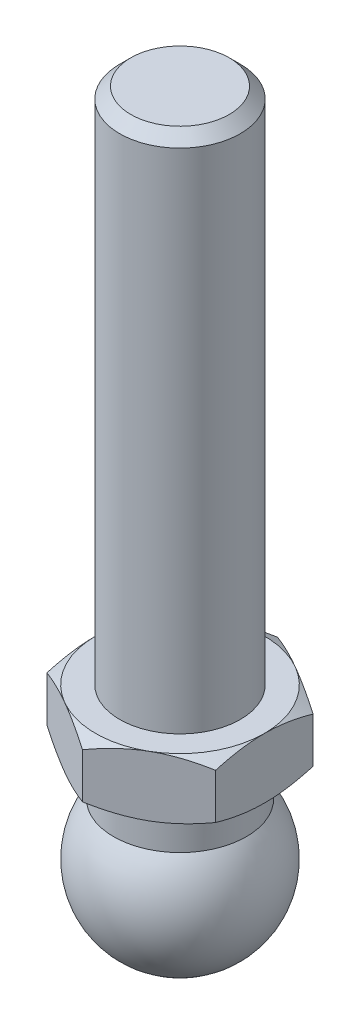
ISO-10303-21;
HEADER;
FILE_DESCRIPTION(('STEP AP214'),'2;1');
FILE_NAME('part.step','',(''),(''),'','','');
FILE_SCHEMA(('AUTOMOTIVE_DESIGN { 1 0 10303 214 1 1 1 1 }'));
ENDSEC;
DATA;
#1=APPLICATION_CONTEXT('core data for automotive mechanical design processes');
#2=APPLICATION_PROTOCOL_DEFINITION('international standard','automotive_design',2000,#1);
#3=PRODUCT_CONTEXT('',#1,'mechanical');
#4=PRODUCT('Part','Part','',(#3));
#5=PRODUCT_RELATED_PRODUCT_CATEGORY('part','',(#4));
#6=PRODUCT_DEFINITION_FORMATION('','',#4);
#7=PRODUCT_DEFINITION_CONTEXT('part definition',#1,'design');
#8=PRODUCT_DEFINITION('design','',#6,#7);
#9=PRODUCT_DEFINITION_SHAPE('','',#8);
#10=(LENGTH_UNIT() NAMED_UNIT(*) SI_UNIT(.MILLI.,.METRE.));
#11=(NAMED_UNIT(*) PLANE_ANGLE_UNIT() SI_UNIT($,.RADIAN.));
#12=(NAMED_UNIT(*) SI_UNIT($,.STERADIAN.) SOLID_ANGLE_UNIT());
#13=UNCERTAINTY_MEASURE_WITH_UNIT(LENGTH_MEASURE(1.E-05),#10,'distance_accuracy_value','');
#14=(GEOMETRIC_REPRESENTATION_CONTEXT(3) GLOBAL_UNCERTAINTY_ASSIGNED_CONTEXT((#13)) GLOBAL_UNIT_ASSIGNED_CONTEXT((#10,
#11,#12)) REPRESENTATION_CONTEXT('',''));
#15=CARTESIAN_POINT('',(0.,0.,0.));
#16=DIRECTION('',(0.,0.,1.));
#17=DIRECTION('',(1.,0.,0.));
#18=AXIS2_PLACEMENT_3D('',#15,#16,#17);
#19=CARTESIAN_POINT('',(0.,19.5,0.));
#20=DIRECTION('',(0.,-1.,0.));
#21=DIRECTION('',(0.,0.,-1.));
#22=AXIS2_PLACEMENT_3D('',#19,#20,#21);
#23=CONICAL_SURFACE('',#22,7.,1.0471975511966);
#24=CARTESIAN_POINT('',(-7.,15.2688336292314,12.5023453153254));
#25=CARTESIAN_POINT('',(-7.,15.4184696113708,12.2052647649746));
#26=CARTESIAN_POINT('',(-7.,15.5671267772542,11.9076861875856));
#27=CARTESIAN_POINT('',(-7.,15.8620076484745,11.3113035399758));
#28=CARTESIAN_POINT('',(-7.,16.0082312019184,11.0124993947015));
#29=CARTESIAN_POINT('',(-7.,16.2980281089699,10.4128982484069));
#30=CARTESIAN_POINT('',(-7.,16.441595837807,10.1120985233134));
#31=CARTESIAN_POINT('',(-7.,16.7251296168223,9.50881013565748));
#32=CARTESIAN_POINT('',(-7.,16.8650957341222,9.20632150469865));
#33=CARTESIAN_POINT('',(-7.,17.1470427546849,8.58510325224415));
#34=CARTESIAN_POINT('',(-7.,17.2888108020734,8.26627671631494));
#35=CARTESIAN_POINT('',(-7.,17.5662200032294,7.62594250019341));
#36=CARTESIAN_POINT('',(-7.,17.7018608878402,7.30443470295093));
#37=CARTESIAN_POINT('',(-7.,17.9652496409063,6.65840905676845));
#38=CARTESIAN_POINT('',(-7.,18.0930022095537,6.33389313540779));
#39=CARTESIAN_POINT('',(-7.,18.3384540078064,5.68109770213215));
#40=CARTESIAN_POINT('',(-7.,18.4561543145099,5.35281859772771));
#41=CARTESIAN_POINT('',(-7.,18.7028165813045,4.61998548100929));
#42=CARTESIAN_POINT('',(-7.,18.8286623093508,4.21436746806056));
#43=CARTESIAN_POINT('',(-7.,19.0543524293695,3.39574912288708));
#44=CARTESIAN_POINT('',(-7.,19.1541980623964,2.98274914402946));
#45=CARTESIAN_POINT('',(-7.,19.2776062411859,2.36178861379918));
#46=CARTESIAN_POINT('',(-7.,19.3141378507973,2.15638627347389));
#47=CARTESIAN_POINT('',(-7.,19.3780104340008,1.74416917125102));
#48=CARTESIAN_POINT('',(-7.,19.4053527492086,1.53735462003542));
#49=CARTESIAN_POINT('',(-7.,19.4500375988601,1.1227076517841));
#50=CARTESIAN_POINT('',(-7.,19.467383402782,0.914875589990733));
#51=CARTESIAN_POINT('',(-7.,19.4915250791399,0.498594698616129));
#52=CARTESIAN_POINT('',(-7.,19.4983210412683,0.290145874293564));
#53=CARTESIAN_POINT('',(-7.,19.5011397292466,-0.128421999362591));
#54=CARTESIAN_POINT('',(-7.,19.4970795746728,-0.338541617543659));
#55=CARTESIAN_POINT('',(-7.,19.4781521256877,-0.758289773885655));
#56=CARTESIAN_POINT('',(-7.,19.463284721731,-0.967918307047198));
#57=CARTESIAN_POINT('',(-7.,19.4232345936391,-1.38625975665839));
#58=CARTESIAN_POINT('',(-7.,19.3980479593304,-1.59497229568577));
#59=CARTESIAN_POINT('',(-7.,19.3381380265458,-2.01100790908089));
#60=CARTESIAN_POINT('',(-7.,19.3034145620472,-2.21833095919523));
#61=CARTESIAN_POINT('',(-7.,19.1849408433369,-2.84522045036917));
#62=CARTESIAN_POINT('',(-7.,19.0876569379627,-3.26225118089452));
#63=CARTESIAN_POINT('',(-7.,18.8658468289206,-4.08879182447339));
#64=CARTESIAN_POINT('',(-7.,18.7413180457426,-4.4983010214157));
#65=CARTESIAN_POINT('',(-7.,18.4953846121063,-5.2406101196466));
#66=CARTESIAN_POINT('',(-7.,18.3771372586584,-5.5744719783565));
#67=CARTESIAN_POINT('',(-7.,18.1300009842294,-6.23825206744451));
#68=CARTESIAN_POINT('',(-7.,18.0011107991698,-6.56816982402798));
#69=CARTESIAN_POINT('',(-7.,17.7350197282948,-7.22486424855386));
#70=CARTESIAN_POINT('',(-7.,17.5978135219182,-7.55163874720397));
#71=CARTESIAN_POINT('',(-7.,17.3169731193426,-8.20238370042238));
#72=CARTESIAN_POINT('',(-7.,17.1733392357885,-8.5263542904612));
#73=CARTESIAN_POINT('',(-7.,16.8876445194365,-9.15729037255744));
#74=CARTESIAN_POINT('',(-7.,16.7458097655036,-9.46435857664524));
#75=CARTESIAN_POINT('',(-7.,16.4583976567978,-10.0767426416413));
#76=CARTESIAN_POINT('',(-7.,16.3128202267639,-10.3820584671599));
#77=CARTESIAN_POINT('',(-7.,16.018926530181,-10.990585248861));
#78=CARTESIAN_POINT('',(-7.,15.8706165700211,-11.2937992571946));
#79=CARTESIAN_POINT('',(-7.,15.5714843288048,-11.8989613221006));
#80=CARTESIAN_POINT('',(-7.,15.4206622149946,-12.2009094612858));
#81=CARTESIAN_POINT('',(-7.,15.2688336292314,-12.5023453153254));
#82=B_SPLINE_CURVE_WITH_KNOTS('',3,(#24,#25,#26,#27,#28,#29,#30,#31,#32,#33,#34,#35,#36,#37,#38,
#39,#40,#41,#42,#43,#44,#45,#46,#47,#48,#49,#50,#51,#52,#53,#54,#55,#56,#57,#58,#59,#60,#61,#62,
#63,#64,#65,#66,#67,#68,#69,#70,#71,#72,#73,#74,#75,#76,#77,#78,#79,#80,#81),.UNSPECIFIED.,.F.,
.F.,(4,2,2,2,2,2,2,2,2,2,2,2,2,2,2,2,2,2,2,2,2,2,2,2,2,2,2,2,4),(0.,0.997917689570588,
1.99589743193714,2.99579247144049,3.99566886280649,5.04239250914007,6.08916209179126,
7.13530182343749,8.18132932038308,9.45480706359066,10.7282240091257,11.3539282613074,
11.9795411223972,12.6049492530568,13.2303520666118,13.8605430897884,14.490740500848,
15.1211769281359,15.7516243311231,17.0349275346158,18.3183522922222,19.380686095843,
20.4431462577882,21.506293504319,22.5693890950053,23.5840866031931,24.5988045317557,
25.6114179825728,26.6239642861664),.UNSPECIFIED.);
#83=CARTESIAN_POINT('',(-7.,18.8747852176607,4.04145188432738));
#84=VERTEX_POINT('',#83);
#85=CARTESIAN_POINT('',(-7.,19.5,0.));
#86=VERTEX_POINT('',#85);
#87=EDGE_CURVE('E255',#84,#86,#82,.T.);
#88=ORIENTED_EDGE('',*,*,#87,.F.);
#89=CARTESIAN_POINT('',(0.0002,18.8747185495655,8.0830192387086));
#90=CARTESIAN_POINT('',(-0.153667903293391,18.9260001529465,7.99418356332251));
#91=CARTESIAN_POINT('',(-0.30810950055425,18.9749544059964,7.90501666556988));
#92=CARTESIAN_POINT('',(-0.618246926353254,19.0675672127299,7.72595873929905));
#93=CARTESIAN_POINT('',(-0.773943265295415,19.1112234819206,7.63606741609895));
#94=CARTESIAN_POINT('',(-1.24352516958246,19.2333884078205,7.36495417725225));
#95=CARTESIAN_POINT('',(-1.5592643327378,19.302874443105,7.18266208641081));
#96=CARTESIAN_POINT('',(-2.03176224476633,19.3843550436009,6.9098652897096));
#97=CARTESIAN_POINT('',(-2.18710922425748,19.4075665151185,6.82017566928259));
#98=CARTESIAN_POINT('',(-2.49850511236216,19.4464887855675,6.64039116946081));
#99=CARTESIAN_POINT('',(-2.65455395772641,19.4622002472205,6.55029632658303));
#100=CARTESIAN_POINT('',(-2.96692267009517,19.4857220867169,6.36995016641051));
#101=CARTESIAN_POINT('',(-3.12324202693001,19.4935414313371,6.27969914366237));
#102=CARTESIAN_POINT('',(-3.43601650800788,19.5011197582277,6.09911871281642));
#103=CARTESIAN_POINT('',(-3.59247162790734,19.500878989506,6.00878930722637));
#104=CARTESIAN_POINT('',(-4.02110687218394,19.4891402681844,5.76131663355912));
#105=CARTESIAN_POINT('',(-4.2931466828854,19.4694342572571,5.60425437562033));
#106=CARTESIAN_POINT('',(-4.83541944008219,19.4069465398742,5.29117305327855));
#107=CARTESIAN_POINT('',(-5.10565047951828,19.364143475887,5.13515508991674));
#108=CARTESIAN_POINT('',(-5.64901454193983,19.2571483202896,4.82144370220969));
#109=CARTESIAN_POINT('',(-5.92207900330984,19.1925029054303,4.66378986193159));
#110=CARTESIAN_POINT('',(-6.46413578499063,19.045783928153,4.35083323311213));
#111=CARTESIAN_POINT('',(-6.73313504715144,18.9637448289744,4.19552643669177));
#112=CARTESIAN_POINT('',(-7.0002,18.8747185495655,4.04133641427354));
#113=B_SPLINE_CURVE_WITH_KNOTS('',3,(#89,#90,#91,#92,#93,#94,#95,#96,#97,#98,#99,#100,#101,#102,
#103,#104,#105,#106,#107,#108,#109,#110,#111,#112),.UNSPECIFIED.,.F.,.F.,(4,2,2,2,2,2,2,2,2,2,2,
4),(0.,0.554727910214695,1.10969417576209,2.2219327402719,2.76443041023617,3.30688013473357,
3.8487128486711,4.39052882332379,5.33376515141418,6.27787517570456,7.2429241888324,
8.20607866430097),.UNSPECIFIED.);
#114=CARTESIAN_POINT('',(-3.5,19.5,6.06217782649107));
#115=VERTEX_POINT('',#114);
#116=EDGE_CURVE('E141',#115,#84,#113,.T.);
#117=ORIENTED_EDGE('',*,*,#116,.F.);
#118=CARTESIAN_POINT('',(0.,19.5,0.));
#119=DIRECTION('',(0.,-1.,0.));
#120=DIRECTION('',(0.,0.,-1.));
#121=AXIS2_PLACEMENT_3D('',#118,#119,#120);
#122=CIRCLE('',#121,7.);
#123=EDGE_CURVE('E223',#115,#86,#122,.T.);
#124=ORIENTED_EDGE('',*,*,#123,.T.);
#125=EDGE_LOOP('',(#88,#117,#124));
#126=FACE_BOUND('',#125,.T.);
#127=ADVANCED_FACE('F14',(#126),#23,.T.);
#128=CARTESIAN_POINT('',(-7.,18.8747852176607,-4.04145188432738));
#129=VERTEX_POINT('',#128);
#130=EDGE_CURVE('E257',#86,#129,#82,.T.);
#131=ORIENTED_EDGE('',*,*,#130,.F.);
#132=CARTESIAN_POINT('',(-3.5,19.5,-6.06217782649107));
#133=VERTEX_POINT('',#132);
#134=EDGE_CURVE('E240',#86,#133,#122,.T.);
#135=ORIENTED_EDGE('',*,*,#134,.T.);
#136=CARTESIAN_POINT('',(-7.0002,18.8747185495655,-4.04133641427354));
#137=CARTESIAN_POINT('',(-6.84633209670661,18.9260001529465,-4.13017208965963));
#138=CARTESIAN_POINT('',(-6.69189049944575,18.9749544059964,-4.21933898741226));
#139=CARTESIAN_POINT('',(-6.38175307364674,19.0675672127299,-4.39839691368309));
#140=CARTESIAN_POINT('',(-6.22605673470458,19.1112234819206,-4.48828823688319));
#141=CARTESIAN_POINT('',(-5.75647483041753,19.2333884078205,-4.75940147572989));
#142=CARTESIAN_POINT('',(-5.4407356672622,19.302874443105,-4.94169356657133));
#143=CARTESIAN_POINT('',(-4.96823775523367,19.3843550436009,-5.21449036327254));
#144=CARTESIAN_POINT('',(-4.81289077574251,19.4075665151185,-5.30417998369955));
#145=CARTESIAN_POINT('',(-4.50149488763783,19.4464887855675,-5.48396448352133));
#146=CARTESIAN_POINT('',(-4.34544604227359,19.4622002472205,-5.57405932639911));
#147=CARTESIAN_POINT('',(-4.03307732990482,19.4857220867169,-5.75440548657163));
#148=CARTESIAN_POINT('',(-3.87675797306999,19.4935414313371,-5.84465650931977));
#149=CARTESIAN_POINT('',(-3.56398349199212,19.5011197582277,-6.02523694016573));
#150=CARTESIAN_POINT('',(-3.40752837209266,19.500878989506,-6.11556634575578));
#151=CARTESIAN_POINT('',(-2.97889312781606,19.4891402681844,-6.36303901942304));
#152=CARTESIAN_POINT('',(-2.7068533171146,19.4694342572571,-6.52010127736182));
#153=CARTESIAN_POINT('',(-2.1645805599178,19.4069465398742,-6.83318259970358));
#154=CARTESIAN_POINT('',(-1.89434952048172,19.364143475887,-6.9892005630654));
#155=CARTESIAN_POINT('',(-1.35098545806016,19.2571483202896,-7.30291195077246));
#156=CARTESIAN_POINT('',(-1.07792099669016,19.1925029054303,-7.46056579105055));
#157=CARTESIAN_POINT('',(-0.53586421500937,19.045783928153,-7.77352241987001));
#158=CARTESIAN_POINT('',(-0.26686495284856,18.9637448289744,-7.92882921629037));
#159=CARTESIAN_POINT('',(0.000200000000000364,18.8747185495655,-8.0830192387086));
#160=B_SPLINE_CURVE_WITH_KNOTS('',3,(#136,#137,#138,#139,#140,#141,#142,#143,#144,#145,#146,
#147,#148,#149,#150,#151,#152,#153,#154,#155,#156,#157,#158,#159),.UNSPECIFIED.,.F.,.F.,(4,2,2,
2,2,2,2,2,2,2,2,4),(0.,0.554727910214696,1.10969417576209,2.2219327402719,2.76443041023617,
3.30688013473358,3.8487128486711,4.39052882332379,5.33376515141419,6.27787517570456,
7.2429241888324,8.20607866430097),.UNSPECIFIED.);
#161=EDGE_CURVE('E298',#129,#133,#160,.T.);
#162=ORIENTED_EDGE('',*,*,#161,.F.);
#163=EDGE_LOOP('',(#131,#135,#162));
#164=FACE_BOUND('',#163,.T.);
#165=ADVANCED_FACE('F179',(#164),#23,.T.);
#166=CARTESIAN_POINT('',(0.,18.8747852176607,-8.08290376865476));
#167=VERTEX_POINT('',#166);
#168=EDGE_CURVE('E293',#133,#167,#160,.T.);
#169=ORIENTED_EDGE('',*,*,#168,.F.);
#170=CARTESIAN_POINT('',(3.5,19.5,-6.06217782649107));
#171=VERTEX_POINT('',#170);
#172=EDGE_CURVE('E234',#133,#171,#122,.T.);
#173=ORIENTED_EDGE('',*,*,#172,.T.);
#174=CARTESIAN_POINT('',(-0.0002,18.8747185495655,-8.0830192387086));
#175=CARTESIAN_POINT('',(0.153667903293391,18.9260001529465,-7.99418356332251));
#176=CARTESIAN_POINT('',(0.30810950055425,18.9749544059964,-7.90501666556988));
#177=CARTESIAN_POINT('',(0.618246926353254,19.0675672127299,-7.72595873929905));
#178=CARTESIAN_POINT('',(0.773943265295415,19.1112234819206,-7.63606741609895));
#179=CARTESIAN_POINT('',(1.24352516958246,19.2333884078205,-7.36495417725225));
#180=CARTESIAN_POINT('',(1.5592643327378,19.302874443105,-7.18266208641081));
#181=CARTESIAN_POINT('',(2.03176224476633,19.3843550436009,-6.9098652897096));
#182=CARTESIAN_POINT('',(2.18710922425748,19.4075665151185,-6.82017566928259));
#183=CARTESIAN_POINT('',(2.49850511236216,19.4464887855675,-6.64039116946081));
#184=CARTESIAN_POINT('',(2.65455395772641,19.4622002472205,-6.55029632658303));
#185=CARTESIAN_POINT('',(2.96692267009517,19.4857220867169,-6.36995016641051));
#186=CARTESIAN_POINT('',(3.12324202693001,19.4935414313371,-6.27969914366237));
#187=CARTESIAN_POINT('',(3.43601650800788,19.5011197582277,-6.09911871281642));
#188=CARTESIAN_POINT('',(3.59247162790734,19.500878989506,-6.00878930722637));
#189=CARTESIAN_POINT('',(4.02110687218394,19.4891402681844,-5.76131663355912));
#190=CARTESIAN_POINT('',(4.2931466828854,19.4694342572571,-5.60425437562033));
#191=CARTESIAN_POINT('',(4.83541944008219,19.4069465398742,-5.29117305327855));
#192=CARTESIAN_POINT('',(5.10565047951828,19.364143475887,-5.13515508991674));
#193=CARTESIAN_POINT('',(5.64901454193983,19.2571483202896,-4.82144370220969));
#194=CARTESIAN_POINT('',(5.92207900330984,19.1925029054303,-4.66378986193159));
#195=CARTESIAN_POINT('',(6.46413578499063,19.045783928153,-4.35083323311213));
#196=CARTESIAN_POINT('',(6.73313504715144,18.9637448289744,-4.19552643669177));
#197=CARTESIAN_POINT('',(7.0002,18.8747185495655,-4.04133641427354));
#198=B_SPLINE_CURVE_WITH_KNOTS('',3,(#174,#175,#176,#177,#178,#179,#180,#181,#182,#183,#184,
#185,#186,#187,#188,#189,#190,#191,#192,#193,#194,#195,#196,#197),.UNSPECIFIED.,.F.,.F.,(4,2,2,
2,2,2,2,2,2,2,2,4),(0.,0.554727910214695,1.10969417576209,2.2219327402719,2.76443041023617,
3.30688013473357,3.8487128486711,4.39052882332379,5.33376515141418,6.27787517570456,
7.2429241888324,8.20607866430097),.UNSPECIFIED.);
#199=EDGE_CURVE('E304',#167,#171,#198,.T.);
#200=ORIENTED_EDGE('',*,*,#199,.F.);
#201=EDGE_LOOP('',(#169,#173,#200));
#202=FACE_BOUND('',#201,.T.);
#203=ADVANCED_FACE('F186',(#202),#23,.T.);
#204=CARTESIAN_POINT('',(7.,18.8747852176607,-4.04145188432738));
#205=VERTEX_POINT('',#204);
#206=EDGE_CURVE('E306',#171,#205,#198,.T.);
#207=ORIENTED_EDGE('',*,*,#206,.F.);
#208=CARTESIAN_POINT('',(7.,19.5,0.));
#209=VERTEX_POINT('',#208);
#210=EDGE_CURVE('E230',#171,#209,#122,.T.);
#211=ORIENTED_EDGE('',*,*,#210,.T.);
#212=CARTESIAN_POINT('',(7.,15.2688336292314,-12.5023453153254));
#213=CARTESIAN_POINT('',(7.,15.4184696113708,-12.2052647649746));
#214=CARTESIAN_POINT('',(7.,15.5671267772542,-11.9076861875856));
#215=CARTESIAN_POINT('',(7.,15.8620076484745,-11.3113035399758));
#216=CARTESIAN_POINT('',(7.,16.0082312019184,-11.0124993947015));
#217=CARTESIAN_POINT('',(7.,16.2980281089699,-10.4128982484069));
#218=CARTESIAN_POINT('',(7.,16.441595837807,-10.1120985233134));
#219=CARTESIAN_POINT('',(7.,16.7251296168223,-9.50881013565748));
#220=CARTESIAN_POINT('',(7.,16.8650957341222,-9.20632150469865));
#221=CARTESIAN_POINT('',(7.,17.1470427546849,-8.58510325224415));
#222=CARTESIAN_POINT('',(7.,17.2888108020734,-8.26627671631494));
#223=CARTESIAN_POINT('',(7.,17.5662200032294,-7.62594250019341));
#224=CARTESIAN_POINT('',(7.,17.7018608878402,-7.30443470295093));
#225=CARTESIAN_POINT('',(7.,17.9652496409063,-6.65840905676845));
#226=CARTESIAN_POINT('',(7.,18.0930022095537,-6.33389313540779));
#227=CARTESIAN_POINT('',(7.,18.3384540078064,-5.68109770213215));
#228=CARTESIAN_POINT('',(7.,18.4561543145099,-5.35281859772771));
#229=CARTESIAN_POINT('',(7.,18.7028165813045,-4.61998548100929));
#230=CARTESIAN_POINT('',(7.,18.8286623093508,-4.21436746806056));
#231=CARTESIAN_POINT('',(7.,19.0543524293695,-3.39574912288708));
#232=CARTESIAN_POINT('',(7.,19.1541980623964,-2.98274914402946));
#233=CARTESIAN_POINT('',(7.,19.2776062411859,-2.36178861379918));
#234=CARTESIAN_POINT('',(7.,19.3141378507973,-2.15638627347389));
#235=CARTESIAN_POINT('',(7.,19.3780104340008,-1.74416917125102));
#236=CARTESIAN_POINT('',(7.,19.4053527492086,-1.53735462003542));
#237=CARTESIAN_POINT('',(7.,19.4500375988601,-1.1227076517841));
#238=CARTESIAN_POINT('',(7.,19.467383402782,-0.914875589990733));
#239=CARTESIAN_POINT('',(7.,19.4915250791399,-0.498594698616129));
#240=CARTESIAN_POINT('',(7.,19.4983210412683,-0.290145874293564));
#241=CARTESIAN_POINT('',(7.,19.5011397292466,0.128421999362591));
#242=CARTESIAN_POINT('',(7.,19.4970795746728,0.338541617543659));
#243=CARTESIAN_POINT('',(7.,19.4781521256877,0.758289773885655));
#244=CARTESIAN_POINT('',(7.,19.463284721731,0.967918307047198));
#245=CARTESIAN_POINT('',(7.,19.4232345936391,1.38625975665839));
#246=CARTESIAN_POINT('',(7.,19.3980479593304,1.59497229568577));
#247=CARTESIAN_POINT('',(7.,19.3381380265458,2.01100790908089));
#248=CARTESIAN_POINT('',(7.,19.3034145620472,2.21833095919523));
#249=CARTESIAN_POINT('',(7.,19.1849408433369,2.84522045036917));
#250=CARTESIAN_POINT('',(7.,19.0876569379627,3.26225118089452));
#251=CARTESIAN_POINT('',(7.,18.8658468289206,4.08879182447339));
#252=CARTESIAN_POINT('',(7.,18.7413180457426,4.4983010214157));
#253=CARTESIAN_POINT('',(7.,18.4953846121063,5.2406101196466));
#254=CARTESIAN_POINT('',(7.,18.3771372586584,5.5744719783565));
#255=CARTESIAN_POINT('',(7.,18.1300009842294,6.23825206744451));
#256=CARTESIAN_POINT('',(7.,18.0011107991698,6.56816982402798));
#257=CARTESIAN_POINT('',(7.,17.7350197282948,7.22486424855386));
#258=CARTESIAN_POINT('',(7.,17.5978135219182,7.55163874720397));
#259=CARTESIAN_POINT('',(7.,17.3169731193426,8.20238370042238));
#260=CARTESIAN_POINT('',(7.,17.1733392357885,8.5263542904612));
#261=CARTESIAN_POINT('',(7.,16.8876445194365,9.15729037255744));
#262=CARTESIAN_POINT('',(7.,16.7458097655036,9.46435857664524));
#263=CARTESIAN_POINT('',(7.,16.4583976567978,10.0767426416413));
#264=CARTESIAN_POINT('',(7.,16.3128202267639,10.3820584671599));
#265=CARTESIAN_POINT('',(7.,16.018926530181,10.990585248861));
#266=CARTESIAN_POINT('',(7.,15.8706165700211,11.2937992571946));
#267=CARTESIAN_POINT('',(7.,15.5714843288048,11.8989613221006));
#268=CARTESIAN_POINT('',(7.,15.4206622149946,12.2009094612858));
#269=CARTESIAN_POINT('',(7.,15.2688336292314,12.5023453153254));
#270=B_SPLINE_CURVE_WITH_KNOTS('',3,(#212,#213,#214,#215,#216,#217,#218,#219,#220,#221,#222,
#223,#224,#225,#226,#227,#228,#229,#230,#231,#232,#233,#234,#235,#236,#237,#238,#239,#240,#241,
#242,#243,#244,#245,#246,#247,#248,#249,#250,#251,#252,#253,#254,#255,#256,#257,#258,#259,#260,
#261,#262,#263,#264,#265,#266,#267,#268,#269),.UNSPECIFIED.,.F.,.F.,(4,2,2,2,2,2,2,2,2,2,2,2,2,
2,2,2,2,2,2,2,2,2,2,2,2,2,2,2,4),(0.,0.997917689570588,1.99589743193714,2.99579247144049,
3.99566886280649,5.04239250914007,6.08916209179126,7.13530182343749,8.18132932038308,
9.45480706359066,10.7282240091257,11.3539282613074,11.9795411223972,12.6049492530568,
13.2303520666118,13.8605430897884,14.490740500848,15.1211769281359,15.7516243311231,
17.0349275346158,18.3183522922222,19.380686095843,20.4431462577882,21.506293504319,
22.5693890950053,23.5840866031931,24.5988045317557,25.6114179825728,26.6239642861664),.UNSPECIFIED.);
#271=EDGE_CURVE('E321',#205,#209,#270,.T.);
#272=ORIENTED_EDGE('',*,*,#271,.F.);
#273=EDGE_LOOP('',(#207,#211,#272));
#274=FACE_BOUND('',#273,.T.);
#275=ADVANCED_FACE('F201',(#274),#23,.T.);
#276=CARTESIAN_POINT('',(7.,18.8747852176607,4.04145188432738));
#277=VERTEX_POINT('',#276);
#278=EDGE_CURVE('E227',#209,#277,#270,.T.);
#279=ORIENTED_EDGE('',*,*,#278,.F.);
#280=CARTESIAN_POINT('',(3.5,19.5,6.06217782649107));
#281=VERTEX_POINT('',#280);
#282=EDGE_CURVE('E220',#209,#281,#122,.T.);
#283=ORIENTED_EDGE('',*,*,#282,.T.);
#284=CARTESIAN_POINT('',(7.0002,18.8747185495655,4.04133641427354));
#285=CARTESIAN_POINT('',(6.84633209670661,18.9260001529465,4.13017208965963));
#286=CARTESIAN_POINT('',(6.69189049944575,18.9749544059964,4.21933898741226));
#287=CARTESIAN_POINT('',(6.38175307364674,19.0675672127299,4.39839691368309));
#288=CARTESIAN_POINT('',(6.22605673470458,19.1112234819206,4.48828823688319));
#289=CARTESIAN_POINT('',(5.75647483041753,19.2333884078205,4.75940147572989));
#290=CARTESIAN_POINT('',(5.4407356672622,19.302874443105,4.94169356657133));
#291=CARTESIAN_POINT('',(4.96823775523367,19.3843550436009,5.21449036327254));
#292=CARTESIAN_POINT('',(4.81289077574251,19.4075665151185,5.30417998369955));
#293=CARTESIAN_POINT('',(4.50149488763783,19.4464887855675,5.48396448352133));
#294=CARTESIAN_POINT('',(4.34544604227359,19.4622002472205,5.57405932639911));
#295=CARTESIAN_POINT('',(4.03307732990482,19.4857220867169,5.75440548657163));
#296=CARTESIAN_POINT('',(3.87675797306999,19.4935414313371,5.84465650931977));
#297=CARTESIAN_POINT('',(3.56398349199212,19.5011197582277,6.02523694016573));
#298=CARTESIAN_POINT('',(3.40752837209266,19.500878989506,6.11556634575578));
#299=CARTESIAN_POINT('',(2.97889312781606,19.4891402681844,6.36303901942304));
#300=CARTESIAN_POINT('',(2.7068533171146,19.4694342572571,6.52010127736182));
#301=CARTESIAN_POINT('',(2.1645805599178,19.4069465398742,6.83318259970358));
#302=CARTESIAN_POINT('',(1.89434952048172,19.364143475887,6.9892005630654));
#303=CARTESIAN_POINT('',(1.35098545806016,19.2571483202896,7.30291195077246));
#304=CARTESIAN_POINT('',(1.07792099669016,19.1925029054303,7.46056579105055));
#305=CARTESIAN_POINT('',(0.53586421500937,19.045783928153,7.77352241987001));
#306=CARTESIAN_POINT('',(0.26686495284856,18.9637448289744,7.92882921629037));
#307=CARTESIAN_POINT('',(-0.000200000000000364,18.8747185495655,8.0830192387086));
#308=B_SPLINE_CURVE_WITH_KNOTS('',3,(#284,#285,#286,#287,#288,#289,#290,#291,#292,#293,#294,
#295,#296,#297,#298,#299,#300,#301,#302,#303,#304,#305,#306,#307),.UNSPECIFIED.,.F.,.F.,(4,2,2,
2,2,2,2,2,2,2,2,4),(0.,0.554727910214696,1.10969417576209,2.2219327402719,2.76443041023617,
3.30688013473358,3.8487128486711,4.39052882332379,5.33376515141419,6.27787517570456,
7.2429241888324,8.20607866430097),.UNSPECIFIED.);
#309=EDGE_CURVE('E210',#277,#281,#308,.T.);
#310=ORIENTED_EDGE('',*,*,#309,.F.);
#311=EDGE_LOOP('',(#279,#283,#310));
#312=FACE_BOUND('',#311,.T.);
#313=ADVANCED_FACE('F192',(#312),#23,.T.);
#314=CARTESIAN_POINT('',(0.,18.8747852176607,8.08290376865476));
#315=VERTEX_POINT('',#314);
#316=EDGE_CURVE('E205',#281,#315,#308,.T.);
#317=ORIENTED_EDGE('',*,*,#316,.F.);
#318=EDGE_CURVE('E207',#281,#115,#122,.T.);
#319=ORIENTED_EDGE('',*,*,#318,.T.);
#320=EDGE_CURVE('E29',#315,#115,#113,.T.);
#321=ORIENTED_EDGE('',*,*,#320,.F.);
#322=EDGE_LOOP('',(#317,#319,#321));
#323=FACE_BOUND('',#322,.T.);
#324=ADVANCED_FACE('F181',(#323),#23,.T.);
#325=CARTESIAN_POINT('',(0.,62.5,0.));
#326=DIRECTION('',(0.,-1.,0.));
#327=DIRECTION('',(0.,0.,-1.));
#328=AXIS2_PLACEMENT_3D('',#325,#326,#327);
#329=PLANE('',#328);
#330=CARTESIAN_POINT('',(0.,62.5,0.));
#331=DIRECTION('',(0.,-1.,0.));
#332=DIRECTION('',(0.,0.,-1.));
#333=AXIS2_PLACEMENT_3D('',#330,#331,#332);
#334=CIRCLE('',#333,4.08);
#335=CARTESIAN_POINT('',(0.,62.5,-4.08));
#336=VERTEX_POINT('',#335);
#337=EDGE_CURVE('E9',#336,#336,#334,.T.);
#338=ORIENTED_EDGE('',*,*,#337,.F.);
#339=EDGE_LOOP('',(#338));
#340=FACE_BOUND('',#339,.T.);
#341=ADVANCED_FACE('F16',(#340),#329,.F.);
#342=CARTESIAN_POINT('',(0.,62.5,0.));
#343=DIRECTION('',(0.,-1.,0.));
#344=DIRECTION('',(0.,0.,-1.));
#345=AXIS2_PLACEMENT_3D('',#342,#343,#344);
#346=CONICAL_SURFACE('',#345,4.08,0.78539816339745);
#347=CARTESIAN_POINT('',(0.,61.58,0.));
#348=DIRECTION('',(0.,-1.,0.));
#349=DIRECTION('',(0.,0.,-1.));
#350=AXIS2_PLACEMENT_3D('',#347,#348,#349);
#351=CIRCLE('',#350,5.);
#352=CARTESIAN_POINT('',(0.,61.58,-5.));
#353=VERTEX_POINT('',#352);
#354=EDGE_CURVE('E22',#353,#353,#351,.T.);
#355=ORIENTED_EDGE('',*,*,#354,.F.);
#356=EDGE_LOOP('',(#355));
#357=FACE_BOUND('',#356,.T.);
#358=ORIENTED_EDGE('',*,*,#337,.T.);
#359=EDGE_LOOP('',(#358));
#360=FACE_BOUND('',#359,.T.);
#361=ADVANCED_FACE('F199',(#357,#360),#346,.T.);
#362=CARTESIAN_POINT('',(0.,0.,0.));
#363=DIRECTION('',(0.,-1.,0.));
#364=DIRECTION('',(0.,0.,-1.));
#365=AXIS2_PLACEMENT_3D('',#362,#363,#364);
#366=CYLINDRICAL_SURFACE('',#365,5.);
#367=CARTESIAN_POINT('',(0.,19.5,0.));
#368=DIRECTION('',(0.,-1.,0.));
#369=DIRECTION('',(0.,0.,-1.));
#370=AXIS2_PLACEMENT_3D('',#367,#368,#369);
#371=CIRCLE('',#370,5.);
#372=CARTESIAN_POINT('',(0.,19.5,-5.));
#373=VERTEX_POINT('',#372);
#374=EDGE_CURVE('E229',#373,#373,#371,.T.);
#375=ORIENTED_EDGE('',*,*,#374,.F.);
#376=EDGE_LOOP('',(#375));
#377=FACE_BOUND('',#376,.T.);
#378=ORIENTED_EDGE('',*,*,#354,.T.);
#379=EDGE_LOOP('',(#378));
#380=FACE_BOUND('',#379,.T.);
#381=ADVANCED_FACE('F385',(#377,#380),#366,.T.);
#382=CARTESIAN_POINT('',(5.,19.5,0.));
#383=DIRECTION('',(0.,-1.,0.));
#384=DIRECTION('',(0.,0.,-1.));
#385=AXIS2_PLACEMENT_3D('',#382,#383,#384);
#386=PLANE('',#385);
#387=ORIENTED_EDGE('',*,*,#282,.F.);
#388=ORIENTED_EDGE('',*,*,#210,.F.);
#389=ORIENTED_EDGE('',*,*,#172,.F.);
#390=ORIENTED_EDGE('',*,*,#134,.F.);
#391=ORIENTED_EDGE('',*,*,#123,.F.);
#392=ORIENTED_EDGE('',*,*,#318,.F.);
#393=EDGE_LOOP('',(#387,#388,#389,#390,#391,#392));
#394=FACE_BOUND('',#393,.T.);
#395=ORIENTED_EDGE('',*,*,#374,.T.);
#396=EDGE_LOOP('',(#395));
#397=FACE_BOUND('',#396,.T.);
#398=ADVANCED_FACE('F217',(#394,#397),#386,.F.);
#399=CARTESIAN_POINT('',(-7.,14.3,-4.04145188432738));
#400=DIRECTION('',(-1.,0.,0.));
#401=DIRECTION('',(0.,0.,1.));
#402=AXIS2_PLACEMENT_3D('',#399,#400,#401);
#403=PLANE('',#402);
#404=ORIENTED_EDGE('',*,*,#87,.T.);
#405=ORIENTED_EDGE('',*,*,#130,.T.);
#406=DIRECTION('',(0.,1.,0.));
#407=VECTOR('',#406,1.);
#408=CARTESIAN_POINT('',(-7.,14.3,-4.04145188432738));
#409=LINE('',#408,#407);
#410=CARTESIAN_POINT('',(-7.,15.1252147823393,-4.04145188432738));
#411=VERTEX_POINT('',#410);
#412=EDGE_CURVE('E120',#411,#129,#409,.T.);
#413=ORIENTED_EDGE('',*,*,#412,.F.);
#414=CARTESIAN_POINT('',(-7.,18.7311663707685,-12.5023453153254));
#415=CARTESIAN_POINT('',(-7.,18.5815303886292,-12.2052647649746));
#416=CARTESIAN_POINT('',(-7.,18.4328732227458,-11.9076861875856));
#417=CARTESIAN_POINT('',(-7.,18.1379923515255,-11.3113035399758));
#418=CARTESIAN_POINT('',(-7.,17.9917687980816,-11.0124993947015));
#419=CARTESIAN_POINT('',(-7.,17.7019718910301,-10.4128982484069));
#420=CARTESIAN_POINT('',(-7.,17.558404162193,-10.1120985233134));
#421=CARTESIAN_POINT('',(-7.,17.2748703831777,-9.50881013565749));
#422=CARTESIAN_POINT('',(-7.,17.1349042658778,-9.20632150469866));
#423=CARTESIAN_POINT('',(-7.,16.8529572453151,-8.58510325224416));
#424=CARTESIAN_POINT('',(-7.,16.7111891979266,-8.26627671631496));
#425=CARTESIAN_POINT('',(-7.,16.4337799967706,-7.62594250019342));
#426=CARTESIAN_POINT('',(-7.,16.2981391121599,-7.30443470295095));
#427=CARTESIAN_POINT('',(-7.,16.0347503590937,-6.65840905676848));
#428=CARTESIAN_POINT('',(-7.,15.9069977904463,-6.33389313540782));
#429=CARTESIAN_POINT('',(-7.,15.6615459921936,-5.68109770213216));
#430=CARTESIAN_POINT('',(-7.,15.5438456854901,-5.35281859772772));
#431=CARTESIAN_POINT('',(-7.,15.2971834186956,-4.6199854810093));
#432=CARTESIAN_POINT('',(-7.,15.1713376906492,-4.21436746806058));
#433=CARTESIAN_POINT('',(-7.,14.9456475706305,-3.39574912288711));
#434=CARTESIAN_POINT('',(-7.,14.8458019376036,-2.98274914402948));
#435=CARTESIAN_POINT('',(-7.,14.7223937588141,-2.3617886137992));
#436=CARTESIAN_POINT('',(-7.,14.6858621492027,-2.1563862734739));
#437=CARTESIAN_POINT('',(-7.,14.6219895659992,-1.74416917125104));
#438=CARTESIAN_POINT('',(-7.,14.5946472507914,-1.53735462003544));
#439=CARTESIAN_POINT('',(-7.,14.5499624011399,-1.12270765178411));
#440=CARTESIAN_POINT('',(-7.,14.532616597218,-0.914875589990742));
#441=CARTESIAN_POINT('',(-7.,14.5084749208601,-0.498594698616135));
#442=CARTESIAN_POINT('',(-7.,14.5016789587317,-0.290145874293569));
#443=CARTESIAN_POINT('',(-7.,14.4988602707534,0.128421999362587));
#444=CARTESIAN_POINT('',(-7.,14.5029204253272,0.338541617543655));
#445=CARTESIAN_POINT('',(-7.,14.5218478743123,0.758289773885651));
#446=CARTESIAN_POINT('',(-7.,14.5367152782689,0.967918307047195));
#447=CARTESIAN_POINT('',(-7.,14.5767654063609,1.38625975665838));
#448=CARTESIAN_POINT('',(-7.,14.6019520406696,1.59497229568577));
#449=CARTESIAN_POINT('',(-7.,14.6618619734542,2.01100790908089));
#450=CARTESIAN_POINT('',(-7.,14.6965854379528,2.21833095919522));
#451=CARTESIAN_POINT('',(-7.,14.8150591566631,2.84522045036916));
#452=CARTESIAN_POINT('',(-7.,14.9123430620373,3.26225118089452));
#453=CARTESIAN_POINT('',(-7.,15.1341531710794,4.08879182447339));
#454=CARTESIAN_POINT('',(-7.,15.2586819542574,4.4983010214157));
#455=CARTESIAN_POINT('',(-7.,15.5046153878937,5.2406101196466));
#456=CARTESIAN_POINT('',(-7.,15.6228627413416,5.5744719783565));
#457=CARTESIAN_POINT('',(-7.,15.8699990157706,6.23825206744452));
#458=CARTESIAN_POINT('',(-7.,15.9988892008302,6.56816982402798));
#459=CARTESIAN_POINT('',(-7.,16.2649802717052,7.22486424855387));
#460=CARTESIAN_POINT('',(-7.,16.4021864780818,7.55163874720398));
#461=CARTESIAN_POINT('',(-7.,16.6830268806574,8.20238370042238));
#462=CARTESIAN_POINT('',(-7.,16.8266607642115,8.5263542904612));
#463=CARTESIAN_POINT('',(-7.,17.1123554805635,9.15729037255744));
#464=CARTESIAN_POINT('',(-7.,17.2541902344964,9.46435857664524));
#465=CARTESIAN_POINT('',(-7.,17.5416023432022,10.0767426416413));
#466=CARTESIAN_POINT('',(-7.,17.6871797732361,10.38205846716));
#467=CARTESIAN_POINT('',(-7.,17.981073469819,10.990585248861));
#468=CARTESIAN_POINT('',(-7.,18.1293834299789,11.2937992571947));
#469=CARTESIAN_POINT('',(-7.,18.4285156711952,11.8989613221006));
#470=CARTESIAN_POINT('',(-7.,18.5793377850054,12.2009094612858));
#471=CARTESIAN_POINT('',(-7.,18.7311663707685,12.5023453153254));
#472=B_SPLINE_CURVE_WITH_KNOTS('',3,(#414,#415,#416,#417,#418,#419,#420,#421,#422,#423,#424,
#425,#426,#427,#428,#429,#430,#431,#432,#433,#434,#435,#436,#437,#438,#439,#440,#441,#442,#443,
#444,#445,#446,#447,#448,#449,#450,#451,#452,#453,#454,#455,#456,#457,#458,#459,#460,#461,#462,
#463,#464,#465,#466,#467,#468,#469,#470,#471),.UNSPECIFIED.,.F.,.F.,(4,2,2,2,2,2,2,2,2,2,2,2,2,
2,2,2,2,2,2,2,2,2,2,2,2,2,2,2,4),(0.,0.997917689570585,1.99589743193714,2.99579247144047,
3.99566886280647,5.04239250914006,6.08916209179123,7.13530182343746,8.18132932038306,
9.45480706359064,10.7282240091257,11.3539282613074,11.9795411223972,12.6049492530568,
13.2303520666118,13.8605430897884,14.490740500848,15.1211769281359,15.7516243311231,
17.0349275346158,18.3183522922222,19.380686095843,20.4431462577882,21.506293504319,
22.5693890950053,23.5840866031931,24.5988045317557,25.6114179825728,26.6239642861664),.UNSPECIFIED.);
#473=CARTESIAN_POINT('',(-7.,14.5,0.));
#474=VERTEX_POINT('',#473);
#475=EDGE_CURVE('E265',#411,#474,#472,.T.);
#476=ORIENTED_EDGE('',*,*,#475,.T.);
#477=CARTESIAN_POINT('',(-7.,15.1252147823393,4.04145188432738));
#478=VERTEX_POINT('',#477);
#479=EDGE_CURVE('E266',#474,#478,#472,.T.);
#480=ORIENTED_EDGE('',*,*,#479,.T.);
#481=DIRECTION('',(0.,1.,0.));
#482=VECTOR('',#481,1.);
#483=CARTESIAN_POINT('',(-7.,14.3,4.04145188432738));
#484=LINE('',#483,#482);
#485=EDGE_CURVE('E114',#478,#84,#484,.T.);
#486=ORIENTED_EDGE('',*,*,#485,.T.);
#487=EDGE_LOOP('',(#404,#405,#413,#476,#480,#486));
#488=FACE_BOUND('',#487,.T.);
#489=ADVANCED_FACE('F272',(#488),#403,.T.);
#490=CARTESIAN_POINT('',(0.,14.3,-8.08290376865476));
#491=DIRECTION('',(-0.5,0.,-0.866025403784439));
#492=DIRECTION('',(-0.866025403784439,0.,0.5));
#493=AXIS2_PLACEMENT_3D('',#490,#491,#492);
#494=PLANE('',#493);
#495=ORIENTED_EDGE('',*,*,#161,.T.);
#496=ORIENTED_EDGE('',*,*,#168,.T.);
#497=DIRECTION('',(0.,1.,0.));
#498=VECTOR('',#497,1.);
#499=CARTESIAN_POINT('',(0.,14.3,-8.08290376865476));
#500=LINE('',#499,#498);
#501=CARTESIAN_POINT('',(0.,15.1252147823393,-8.08290376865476));
#502=VERTEX_POINT('',#501);
#503=EDGE_CURVE('E124',#502,#167,#500,.T.);
#504=ORIENTED_EDGE('',*,*,#503,.F.);
#505=CARTESIAN_POINT('',(0.000200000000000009,15.1252814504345,-8.0830192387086));
#506=CARTESIAN_POINT('',(-0.153667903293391,15.0739998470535,-7.99418356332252));
#507=CARTESIAN_POINT('',(-0.30810950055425,15.0250455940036,-7.90501666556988));
#508=CARTESIAN_POINT('',(-0.618246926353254,14.9324327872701,-7.72595873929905));
#509=CARTESIAN_POINT('',(-0.773943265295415,14.8887765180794,-7.63606741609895));
#510=CARTESIAN_POINT('',(-1.24352516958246,14.7666115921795,-7.36495417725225));
#511=CARTESIAN_POINT('',(-1.5592643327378,14.697125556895,-7.18266208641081));
#512=CARTESIAN_POINT('',(-2.03176224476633,14.6156449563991,-6.9098652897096));
#513=CARTESIAN_POINT('',(-2.18710922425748,14.5924334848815,-6.82017566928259));
#514=CARTESIAN_POINT('',(-2.49850511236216,14.5535112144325,-6.64039116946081));
#515=CARTESIAN_POINT('',(-2.65455395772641,14.5377997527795,-6.55029632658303));
#516=CARTESIAN_POINT('',(-2.96692267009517,14.5142779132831,-6.36995016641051));
#517=CARTESIAN_POINT('',(-3.12324202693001,14.5064585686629,-6.27969914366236));
#518=CARTESIAN_POINT('',(-3.43601650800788,14.4988802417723,-6.09911871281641));
#519=CARTESIAN_POINT('',(-3.59247162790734,14.499121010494,-6.00878930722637));
#520=CARTESIAN_POINT('',(-4.02110687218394,14.5108597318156,-5.76131663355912));
#521=CARTESIAN_POINT('',(-4.2931466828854,14.5305657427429,-5.60425437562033));
#522=CARTESIAN_POINT('',(-4.8354194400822,14.5930534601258,-5.29117305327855));
#523=CARTESIAN_POINT('',(-5.10565047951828,14.635856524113,-5.13515508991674));
#524=CARTESIAN_POINT('',(-5.64901454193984,14.7428516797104,-4.82144370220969));
#525=CARTESIAN_POINT('',(-5.92207900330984,14.8074970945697,-4.66378986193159));
#526=CARTESIAN_POINT('',(-6.46413578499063,14.954216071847,-4.35083323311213));
#527=CARTESIAN_POINT('',(-6.73313504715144,15.0362551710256,-4.19552643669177));
#528=CARTESIAN_POINT('',(-7.0002,15.1252814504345,-4.04133641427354));
#529=B_SPLINE_CURVE_WITH_KNOTS('',3,(#505,#506,#507,#508,#509,#510,#511,#512,#513,#514,#515,
#516,#517,#518,#519,#520,#521,#522,#523,#524,#525,#526,#527,#528),.UNSPECIFIED.,.F.,.F.,(4,2,2,
2,2,2,2,2,2,2,2,4),(0.,0.554727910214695,1.10969417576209,2.2219327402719,2.76443041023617,
3.30688013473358,3.8487128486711,4.39052882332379,5.33376515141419,6.27787517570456,
7.2429241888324,8.20607866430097),.UNSPECIFIED.);
#530=CARTESIAN_POINT('',(-3.5,14.5,-6.06217782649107));
#531=VERTEX_POINT('',#530);
#532=EDGE_CURVE('E299',#502,#531,#529,.T.);
#533=ORIENTED_EDGE('',*,*,#532,.T.);
#534=EDGE_CURVE('E287',#531,#411,#529,.T.);
#535=ORIENTED_EDGE('',*,*,#534,.T.);
#536=ORIENTED_EDGE('',*,*,#412,.T.);
#537=EDGE_LOOP('',(#495,#496,#504,#533,#535,#536));
#538=FACE_BOUND('',#537,.T.);
#539=ADVANCED_FACE('F276',(#538),#494,.T.);
#540=CARTESIAN_POINT('',(7.,14.3,-4.04145188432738));
#541=DIRECTION('',(0.5,0.,-0.866025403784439));
#542=DIRECTION('',(-0.866025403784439,0.,-0.5));
#543=AXIS2_PLACEMENT_3D('',#540,#541,#542);
#544=PLANE('',#543);
#545=ORIENTED_EDGE('',*,*,#199,.T.);
#546=ORIENTED_EDGE('',*,*,#206,.T.);
#547=DIRECTION('',(0.,1.,0.));
#548=VECTOR('',#547,1.);
#549=CARTESIAN_POINT('',(7.,14.3,-4.04145188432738));
#550=LINE('',#549,#548);
#551=CARTESIAN_POINT('',(7.,15.1252147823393,-4.04145188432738));
#552=VERTEX_POINT('',#551);
#553=EDGE_CURVE('E127',#552,#205,#550,.T.);
#554=ORIENTED_EDGE('',*,*,#553,.F.);
#555=CARTESIAN_POINT('',(7.0002,15.1252814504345,-4.04133641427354));
#556=CARTESIAN_POINT('',(6.84633209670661,15.0739998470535,-4.13017208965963));
#557=CARTESIAN_POINT('',(6.69189049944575,15.0250455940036,-4.21933898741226));
#558=CARTESIAN_POINT('',(6.38175307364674,14.9324327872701,-4.39839691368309));
#559=CARTESIAN_POINT('',(6.22605673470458,14.8887765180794,-4.48828823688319));
#560=CARTESIAN_POINT('',(5.75647483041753,14.7666115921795,-4.75940147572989));
#561=CARTESIAN_POINT('',(5.4407356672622,14.697125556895,-4.94169356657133));
#562=CARTESIAN_POINT('',(4.96823775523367,14.6156449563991,-5.21449036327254));
#563=CARTESIAN_POINT('',(4.81289077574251,14.5924334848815,-5.30417998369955));
#564=CARTESIAN_POINT('',(4.50149488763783,14.5535112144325,-5.48396448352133));
#565=CARTESIAN_POINT('',(4.34544604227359,14.5377997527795,-5.57405932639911));
#566=CARTESIAN_POINT('',(4.03307732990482,14.5142779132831,-5.75440548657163));
#567=CARTESIAN_POINT('',(3.87675797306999,14.5064585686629,-5.84465650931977));
#568=CARTESIAN_POINT('',(3.56398349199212,14.4988802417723,-6.02523694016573));
#569=CARTESIAN_POINT('',(3.40752837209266,14.499121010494,-6.11556634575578));
#570=CARTESIAN_POINT('',(2.97889312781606,14.5108597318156,-6.36303901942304));
#571=CARTESIAN_POINT('',(2.7068533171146,14.5305657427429,-6.52010127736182));
#572=CARTESIAN_POINT('',(2.1645805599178,14.5930534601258,-6.83318259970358));
#573=CARTESIAN_POINT('',(1.89434952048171,14.635856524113,-6.9892005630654));
#574=CARTESIAN_POINT('',(1.35098545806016,14.7428516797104,-7.30291195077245));
#575=CARTESIAN_POINT('',(1.07792099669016,14.8074970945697,-7.46056579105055));
#576=CARTESIAN_POINT('',(0.53586421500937,14.954216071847,-7.77352241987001));
#577=CARTESIAN_POINT('',(0.266864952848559,15.0362551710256,-7.92882921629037));
#578=CARTESIAN_POINT('',(-0.000199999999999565,15.1252814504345,-8.0830192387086));
#579=B_SPLINE_CURVE_WITH_KNOTS('',3,(#555,#556,#557,#558,#559,#560,#561,#562,#563,#564,#565,
#566,#567,#568,#569,#570,#571,#572,#573,#574,#575,#576,#577,#578),.UNSPECIFIED.,.F.,.F.,(4,2,2,
2,2,2,2,2,2,2,2,4),(0.,0.554727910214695,1.10969417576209,2.2219327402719,2.76443041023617,
3.30688013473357,3.8487128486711,4.39052882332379,5.33376515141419,6.27787517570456,
7.2429241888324,8.20607866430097),.UNSPECIFIED.);
#580=CARTESIAN_POINT('',(3.5,14.5,-6.06217782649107));
#581=VERTEX_POINT('',#580);
#582=EDGE_CURVE('E309',#552,#581,#579,.T.);
#583=ORIENTED_EDGE('',*,*,#582,.T.);
#584=EDGE_CURVE('E315',#581,#502,#579,.T.);
#585=ORIENTED_EDGE('',*,*,#584,.T.);
#586=ORIENTED_EDGE('',*,*,#503,.T.);
#587=EDGE_LOOP('',(#545,#546,#554,#583,#585,#586));
#588=FACE_BOUND('',#587,.T.);
#589=ADVANCED_FACE('F282',(#588),#544,.T.);
#590=CARTESIAN_POINT('',(7.,14.3,4.04145188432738));
#591=DIRECTION('',(1.,0.,0.));
#592=DIRECTION('',(0.,0.,-1.));
#593=AXIS2_PLACEMENT_3D('',#590,#591,#592);
#594=PLANE('',#593);
#595=ORIENTED_EDGE('',*,*,#271,.T.);
#596=ORIENTED_EDGE('',*,*,#278,.T.);
#597=DIRECTION('',(0.,1.,0.));
#598=VECTOR('',#597,1.);
#599=CARTESIAN_POINT('',(7.,14.3,4.04145188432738));
#600=LINE('',#599,#598);
#601=CARTESIAN_POINT('',(7.,15.1252147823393,4.04145188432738));
#602=VERTEX_POINT('',#601);
#603=EDGE_CURVE('E130',#602,#277,#600,.T.);
#604=ORIENTED_EDGE('',*,*,#603,.F.);
#605=CARTESIAN_POINT('',(7.,18.7311663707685,12.5023453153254));
#606=CARTESIAN_POINT('',(7.,18.5815303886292,12.2052647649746));
#607=CARTESIAN_POINT('',(7.,18.4328732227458,11.9076861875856));
#608=CARTESIAN_POINT('',(7.,18.1379923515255,11.3113035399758));
#609=CARTESIAN_POINT('',(7.,17.9917687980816,11.0124993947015));
#610=CARTESIAN_POINT('',(7.,17.7019718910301,10.4128982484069));
#611=CARTESIAN_POINT('',(7.,17.558404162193,10.1120985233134));
#612=CARTESIAN_POINT('',(7.,17.2748703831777,9.50881013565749));
#613=CARTESIAN_POINT('',(7.,17.1349042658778,9.20632150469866));
#614=CARTESIAN_POINT('',(7.,16.8529572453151,8.58510325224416));
#615=CARTESIAN_POINT('',(7.,16.7111891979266,8.26627671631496));
#616=CARTESIAN_POINT('',(7.,16.4337799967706,7.62594250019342));
#617=CARTESIAN_POINT('',(7.,16.2981391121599,7.30443470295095));
#618=CARTESIAN_POINT('',(7.,16.0347503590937,6.65840905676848));
#619=CARTESIAN_POINT('',(7.,15.9069977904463,6.33389313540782));
#620=CARTESIAN_POINT('',(7.,15.6615459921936,5.68109770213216));
#621=CARTESIAN_POINT('',(7.,15.5438456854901,5.35281859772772));
#622=CARTESIAN_POINT('',(7.,15.2971834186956,4.6199854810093));
#623=CARTESIAN_POINT('',(7.,15.1713376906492,4.21436746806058));
#624=CARTESIAN_POINT('',(7.,14.9456475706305,3.39574912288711));
#625=CARTESIAN_POINT('',(7.,14.8458019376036,2.98274914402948));
#626=CARTESIAN_POINT('',(7.,14.7223937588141,2.3617886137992));
#627=CARTESIAN_POINT('',(7.,14.6858621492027,2.1563862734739));
#628=CARTESIAN_POINT('',(7.,14.6219895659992,1.74416917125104));
#629=CARTESIAN_POINT('',(7.,14.5946472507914,1.53735462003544));
#630=CARTESIAN_POINT('',(7.,14.5499624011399,1.12270765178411));
#631=CARTESIAN_POINT('',(7.,14.532616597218,0.914875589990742));
#632=CARTESIAN_POINT('',(7.,14.5084749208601,0.498594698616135));
#633=CARTESIAN_POINT('',(7.,14.5016789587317,0.290145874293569));
#634=CARTESIAN_POINT('',(7.,14.4988602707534,-0.128421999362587));
#635=CARTESIAN_POINT('',(7.,14.5029204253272,-0.338541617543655));
#636=CARTESIAN_POINT('',(7.,14.5218478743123,-0.758289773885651));
#637=CARTESIAN_POINT('',(7.,14.5367152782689,-0.967918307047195));
#638=CARTESIAN_POINT('',(7.,14.5767654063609,-1.38625975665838));
#639=CARTESIAN_POINT('',(7.,14.6019520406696,-1.59497229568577));
#640=CARTESIAN_POINT('',(7.,14.6618619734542,-2.01100790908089));
#641=CARTESIAN_POINT('',(7.,14.6965854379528,-2.21833095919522));
#642=CARTESIAN_POINT('',(7.,14.8150591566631,-2.84522045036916));
#643=CARTESIAN_POINT('',(7.,14.9123430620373,-3.26225118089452));
#644=CARTESIAN_POINT('',(7.,15.1341531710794,-4.08879182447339));
#645=CARTESIAN_POINT('',(7.,15.2586819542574,-4.4983010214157));
#646=CARTESIAN_POINT('',(7.,15.5046153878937,-5.2406101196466));
#647=CARTESIAN_POINT('',(7.,15.6228627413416,-5.5744719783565));
#648=CARTESIAN_POINT('',(7.,15.8699990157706,-6.23825206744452));
#649=CARTESIAN_POINT('',(7.,15.9988892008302,-6.56816982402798));
#650=CARTESIAN_POINT('',(7.,16.2649802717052,-7.22486424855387));
#651=CARTESIAN_POINT('',(7.,16.4021864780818,-7.55163874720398));
#652=CARTESIAN_POINT('',(7.,16.6830268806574,-8.20238370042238));
#653=CARTESIAN_POINT('',(7.,16.8266607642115,-8.5263542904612));
#654=CARTESIAN_POINT('',(7.,17.1123554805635,-9.15729037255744));
#655=CARTESIAN_POINT('',(7.,17.2541902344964,-9.46435857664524));
#656=CARTESIAN_POINT('',(7.,17.5416023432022,-10.0767426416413));
#657=CARTESIAN_POINT('',(7.,17.6871797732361,-10.38205846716));
#658=CARTESIAN_POINT('',(7.,17.981073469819,-10.990585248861));
#659=CARTESIAN_POINT('',(7.,18.1293834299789,-11.2937992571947));
#660=CARTESIAN_POINT('',(7.,18.4285156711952,-11.8989613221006));
#661=CARTESIAN_POINT('',(7.,18.5793377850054,-12.2009094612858));
#662=CARTESIAN_POINT('',(7.,18.7311663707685,-12.5023453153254));
#663=B_SPLINE_CURVE_WITH_KNOTS('',3,(#605,#606,#607,#608,#609,#610,#611,#612,#613,#614,#615,
#616,#617,#618,#619,#620,#621,#622,#623,#624,#625,#626,#627,#628,#629,#630,#631,#632,#633,#634,
#635,#636,#637,#638,#639,#640,#641,#642,#643,#644,#645,#646,#647,#648,#649,#650,#651,#652,#653,
#654,#655,#656,#657,#658,#659,#660,#661,#662),.UNSPECIFIED.,.F.,.F.,(4,2,2,2,2,2,2,2,2,2,2,2,2,
2,2,2,2,2,2,2,2,2,2,2,2,2,2,2,4),(0.,0.997917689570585,1.99589743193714,2.99579247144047,
3.99566886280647,5.04239250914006,6.08916209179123,7.13530182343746,8.18132932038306,
9.45480706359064,10.7282240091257,11.3539282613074,11.9795411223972,12.6049492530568,
13.2303520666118,13.8605430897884,14.490740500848,15.1211769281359,15.7516243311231,
17.0349275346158,18.3183522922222,19.380686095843,20.4431462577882,21.506293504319,
22.5693890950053,23.5840866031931,24.5988045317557,25.6114179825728,26.6239642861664),.UNSPECIFIED.);
#664=CARTESIAN_POINT('',(7.,14.5,0.));
#665=VERTEX_POINT('',#664);
#666=EDGE_CURVE('E327',#602,#665,#663,.T.);
#667=ORIENTED_EDGE('',*,*,#666,.T.);
#668=EDGE_CURVE('E328',#665,#552,#663,.T.);
#669=ORIENTED_EDGE('',*,*,#668,.T.);
#670=ORIENTED_EDGE('',*,*,#553,.T.);
#671=EDGE_LOOP('',(#595,#596,#604,#667,#669,#670));
#672=FACE_BOUND('',#671,.T.);
#673=ADVANCED_FACE('F333',(#672),#594,.T.);
#674=CARTESIAN_POINT('',(0.,14.3,8.08290376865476));
#675=DIRECTION('',(0.5,0.,0.866025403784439));
#676=DIRECTION('',(0.866025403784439,0.,-0.5));
#677=AXIS2_PLACEMENT_3D('',#674,#675,#676);
#678=PLANE('',#677);
#679=ORIENTED_EDGE('',*,*,#309,.T.);
#680=ORIENTED_EDGE('',*,*,#316,.T.);
#681=DIRECTION('',(0.,1.,0.));
#682=VECTOR('',#681,1.);
#683=CARTESIAN_POINT('',(0.,14.3,8.08290376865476));
#684=LINE('',#683,#682);
#685=CARTESIAN_POINT('',(0.,15.1252147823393,8.08290376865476));
#686=VERTEX_POINT('',#685);
#687=EDGE_CURVE('E117',#686,#315,#684,.T.);
#688=ORIENTED_EDGE('',*,*,#687,.F.);
#689=CARTESIAN_POINT('',(-0.000200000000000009,15.1252814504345,8.0830192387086));
#690=CARTESIAN_POINT('',(0.153667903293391,15.0739998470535,7.99418356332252));
#691=CARTESIAN_POINT('',(0.30810950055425,15.0250455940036,7.90501666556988));
#692=CARTESIAN_POINT('',(0.618246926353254,14.9324327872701,7.72595873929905));
#693=CARTESIAN_POINT('',(0.773943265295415,14.8887765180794,7.63606741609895));
#694=CARTESIAN_POINT('',(1.24352516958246,14.7666115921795,7.36495417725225));
#695=CARTESIAN_POINT('',(1.5592643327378,14.697125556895,7.18266208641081));
#696=CARTESIAN_POINT('',(2.03176224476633,14.6156449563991,6.9098652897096));
#697=CARTESIAN_POINT('',(2.18710922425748,14.5924334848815,6.82017566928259));
#698=CARTESIAN_POINT('',(2.49850511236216,14.5535112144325,6.64039116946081));
#699=CARTESIAN_POINT('',(2.65455395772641,14.5377997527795,6.55029632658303));
#700=CARTESIAN_POINT('',(2.96692267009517,14.5142779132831,6.36995016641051));
#701=CARTESIAN_POINT('',(3.12324202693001,14.5064585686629,6.27969914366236));
#702=CARTESIAN_POINT('',(3.43601650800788,14.4988802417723,6.09911871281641));
#703=CARTESIAN_POINT('',(3.59247162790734,14.499121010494,6.00878930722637));
#704=CARTESIAN_POINT('',(4.02110687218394,14.5108597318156,5.76131663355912));
#705=CARTESIAN_POINT('',(4.2931466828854,14.5305657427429,5.60425437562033));
#706=CARTESIAN_POINT('',(4.8354194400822,14.5930534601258,5.29117305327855));
#707=CARTESIAN_POINT('',(5.10565047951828,14.635856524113,5.13515508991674));
#708=CARTESIAN_POINT('',(5.64901454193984,14.7428516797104,4.82144370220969));
#709=CARTESIAN_POINT('',(5.92207900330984,14.8074970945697,4.66378986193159));
#710=CARTESIAN_POINT('',(6.46413578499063,14.954216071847,4.35083323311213));
#711=CARTESIAN_POINT('',(6.73313504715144,15.0362551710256,4.19552643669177));
#712=CARTESIAN_POINT('',(7.0002,15.1252814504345,4.04133641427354));
#713=B_SPLINE_CURVE_WITH_KNOTS('',3,(#689,#690,#691,#692,#693,#694,#695,#696,#697,#698,#699,
#700,#701,#702,#703,#704,#705,#706,#707,#708,#709,#710,#711,#712),.UNSPECIFIED.,.F.,.F.,(4,2,2,
2,2,2,2,2,2,2,2,4),(0.,0.554727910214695,1.10969417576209,2.2219327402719,2.76443041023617,
3.30688013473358,3.8487128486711,4.39052882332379,5.33376515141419,6.27787517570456,
7.2429241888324,8.20607866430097),.UNSPECIFIED.);
#714=CARTESIAN_POINT('',(3.5,14.5,6.06217782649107));
#715=VERTEX_POINT('',#714);
#716=EDGE_CURVE('E211',#686,#715,#713,.T.);
#717=ORIENTED_EDGE('',*,*,#716,.T.);
#718=EDGE_CURVE('E521',#715,#602,#713,.T.);
#719=ORIENTED_EDGE('',*,*,#718,.T.);
#720=ORIENTED_EDGE('',*,*,#603,.T.);
#721=EDGE_LOOP('',(#679,#680,#688,#717,#719,#720));
#722=FACE_BOUND('',#721,.T.);
#723=ADVANCED_FACE('F157',(#722),#678,.T.);
#724=CARTESIAN_POINT('',(-7.,14.3,4.04145188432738));
#725=DIRECTION('',(-0.5,0.,0.866025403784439));
#726=DIRECTION('',(0.866025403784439,0.,0.5));
#727=AXIS2_PLACEMENT_3D('',#724,#725,#726);
#728=PLANE('',#727);
#729=ORIENTED_EDGE('',*,*,#320,.T.);
#730=ORIENTED_EDGE('',*,*,#116,.T.);
#731=ORIENTED_EDGE('',*,*,#485,.F.);
#732=CARTESIAN_POINT('',(-7.0002,15.1252814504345,4.04133641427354));
#733=CARTESIAN_POINT('',(-6.84633209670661,15.0739998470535,4.13017208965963));
#734=CARTESIAN_POINT('',(-6.69189049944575,15.0250455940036,4.21933898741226));
#735=CARTESIAN_POINT('',(-6.38175307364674,14.9324327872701,4.39839691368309));
#736=CARTESIAN_POINT('',(-6.22605673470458,14.8887765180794,4.48828823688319));
#737=CARTESIAN_POINT('',(-5.75647483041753,14.7666115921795,4.75940147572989));
#738=CARTESIAN_POINT('',(-5.4407356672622,14.697125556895,4.94169356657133));
#739=CARTESIAN_POINT('',(-4.96823775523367,14.6156449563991,5.21449036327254));
#740=CARTESIAN_POINT('',(-4.81289077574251,14.5924334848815,5.30417998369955));
#741=CARTESIAN_POINT('',(-4.50149488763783,14.5535112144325,5.48396448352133));
#742=CARTESIAN_POINT('',(-4.34544604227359,14.5377997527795,5.57405932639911));
#743=CARTESIAN_POINT('',(-4.03307732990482,14.5142779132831,5.75440548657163));
#744=CARTESIAN_POINT('',(-3.87675797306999,14.5064585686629,5.84465650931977));
#745=CARTESIAN_POINT('',(-3.56398349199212,14.4988802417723,6.02523694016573));
#746=CARTESIAN_POINT('',(-3.40752837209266,14.499121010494,6.11556634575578));
#747=CARTESIAN_POINT('',(-2.97889312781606,14.5108597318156,6.36303901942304));
#748=CARTESIAN_POINT('',(-2.7068533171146,14.5305657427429,6.52010127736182));
#749=CARTESIAN_POINT('',(-2.1645805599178,14.5930534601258,6.83318259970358));
#750=CARTESIAN_POINT('',(-1.89434952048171,14.635856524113,6.9892005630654));
#751=CARTESIAN_POINT('',(-1.35098545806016,14.7428516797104,7.30291195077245));
#752=CARTESIAN_POINT('',(-1.07792099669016,14.8074970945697,7.46056579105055));
#753=CARTESIAN_POINT('',(-0.53586421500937,14.954216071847,7.77352241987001));
#754=CARTESIAN_POINT('',(-0.266864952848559,15.0362551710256,7.92882921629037));
#755=CARTESIAN_POINT('',(0.000199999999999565,15.1252814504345,8.0830192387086));
#756=B_SPLINE_CURVE_WITH_KNOTS('',3,(#732,#733,#734,#735,#736,#737,#738,#739,#740,#741,#742,
#743,#744,#745,#746,#747,#748,#749,#750,#751,#752,#753,#754,#755),.UNSPECIFIED.,.F.,.F.,(4,2,2,
2,2,2,2,2,2,2,2,4),(0.,0.554727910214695,1.10969417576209,2.2219327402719,2.76443041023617,
3.30688013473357,3.8487128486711,4.39052882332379,5.33376515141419,6.27787517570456,
7.2429241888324,8.20607866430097),.UNSPECIFIED.);
#757=CARTESIAN_POINT('',(-3.5,14.5,6.06217782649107));
#758=VERTEX_POINT('',#757);
#759=EDGE_CURVE('E36',#478,#758,#756,.T.);
#760=ORIENTED_EDGE('',*,*,#759,.T.);
#761=EDGE_CURVE('E123',#758,#686,#756,.T.);
#762=ORIENTED_EDGE('',*,*,#761,.T.);
#763=ORIENTED_EDGE('',*,*,#687,.T.);
#764=EDGE_LOOP('',(#729,#730,#731,#760,#762,#763));
#765=FACE_BOUND('',#764,.T.);
#766=ADVANCED_FACE('F151',(#765),#728,.T.);
#767=CARTESIAN_POINT('',(0.,0.,0.));
#768=DIRECTION('',(0.,-1.,0.));
#769=DIRECTION('',(0.,0.,-1.));
#770=AXIS2_PLACEMENT_3D('',#767,#768,#769);
#771=CYLINDRICAL_SURFACE('',#770,5.5);
#772=CARTESIAN_POINT('',(0.,11.3301270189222,0.));
#773=DIRECTION('',(0.,-1.,0.));
#774=DIRECTION('',(0.,0.,-1.));
#775=AXIS2_PLACEMENT_3D('',#772,#773,#774);
#776=CIRCLE('',#775,5.5);
#777=CARTESIAN_POINT('',(0.,11.3301270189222,-5.5));
#778=VERTEX_POINT('',#777);
#779=EDGE_CURVE('E112',#778,#778,#776,.T.);
#780=ORIENTED_EDGE('',*,*,#779,.F.);
#781=EDGE_LOOP('',(#780));
#782=FACE_BOUND('',#781,.T.);
#783=CARTESIAN_POINT('',(0.,14.5,0.));
#784=DIRECTION('',(0.,-1.,0.));
#785=DIRECTION('',(0.,0.,-1.));
#786=AXIS2_PLACEMENT_3D('',#783,#784,#785);
#787=CIRCLE('',#786,5.5);
#788=CARTESIAN_POINT('',(0.,14.5,-5.5));
#789=VERTEX_POINT('',#788);
#790=EDGE_CURVE('E250',#789,#789,#787,.T.);
#791=ORIENTED_EDGE('',*,*,#790,.T.);
#792=EDGE_LOOP('',(#791));
#793=FACE_BOUND('',#792,.T.);
#794=ADVANCED_FACE('F156',(#782,#793),#771,.T.);
#795=CARTESIAN_POINT('',(0.,17.,0.));
#796=DIRECTION('',(0.,1.,0.));
#797=DIRECTION('',(0.,0.,1.));
#798=AXIS2_PLACEMENT_3D('',#795,#796,#797);
#799=CONICAL_SURFACE('',#798,11.3301270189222,1.0471975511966);
#800=ORIENTED_EDGE('',*,*,#582,.F.);
#801=ORIENTED_EDGE('',*,*,#668,.F.);
#802=CARTESIAN_POINT('',(0.,14.5,0.));
#803=DIRECTION('',(0.,-1.,0.));
#804=DIRECTION('',(0.,0.,-1.));
#805=AXIS2_PLACEMENT_3D('',#802,#803,#804);
#806=CIRCLE('',#805,7.);
#807=EDGE_CURVE('E243',#581,#665,#806,.T.);
#808=ORIENTED_EDGE('',*,*,#807,.F.);
#809=EDGE_LOOP('',(#800,#801,#808));
#810=FACE_BOUND('',#809,.T.);
#811=ADVANCED_FACE('F148',(#810),#799,.T.);
#812=ORIENTED_EDGE('',*,*,#584,.F.);
#813=EDGE_CURVE('E249',#531,#581,#806,.T.);
#814=ORIENTED_EDGE('',*,*,#813,.F.);
#815=ORIENTED_EDGE('',*,*,#532,.F.);
#816=EDGE_LOOP('',(#812,#814,#815));
#817=FACE_BOUND('',#816,.T.);
#818=ADVANCED_FACE('F452',(#817),#799,.T.);
#819=ORIENTED_EDGE('',*,*,#534,.F.);
#820=EDGE_CURVE('E253',#474,#531,#806,.T.);
#821=ORIENTED_EDGE('',*,*,#820,.F.);
#822=ORIENTED_EDGE('',*,*,#475,.F.);
#823=EDGE_LOOP('',(#819,#821,#822));
#824=FACE_BOUND('',#823,.T.);
#825=ADVANCED_FACE('F175',(#824),#799,.T.);
#826=ORIENTED_EDGE('',*,*,#479,.F.);
#827=EDGE_CURVE('E247',#758,#474,#806,.T.);
#828=ORIENTED_EDGE('',*,*,#827,.F.);
#829=ORIENTED_EDGE('',*,*,#759,.F.);
#830=EDGE_LOOP('',(#826,#828,#829));
#831=FACE_BOUND('',#830,.T.);
#832=ADVANCED_FACE('F173',(#831),#799,.T.);
#833=ORIENTED_EDGE('',*,*,#666,.F.);
#834=ORIENTED_EDGE('',*,*,#718,.F.);
#835=EDGE_CURVE('E235',#665,#715,#806,.T.);
#836=ORIENTED_EDGE('',*,*,#835,.F.);
#837=EDGE_LOOP('',(#833,#834,#836));
#838=FACE_BOUND('',#837,.T.);
#839=ADVANCED_FACE('F164',(#838),#799,.T.);
#840=CARTESIAN_POINT('',(7.,14.5,0.));
#841=DIRECTION('',(0.,1.,0.));
#842=DIRECTION('',(0.,0.,1.));
#843=AXIS2_PLACEMENT_3D('',#840,#841,#842);
#844=PLANE('',#843);
#845=ORIENTED_EDGE('',*,*,#790,.F.);
#846=EDGE_LOOP('',(#845));
#847=FACE_BOUND('',#846,.T.);
#848=ORIENTED_EDGE('',*,*,#807,.T.);
#849=ORIENTED_EDGE('',*,*,#835,.T.);
#850=EDGE_CURVE('E242',#715,#758,#806,.T.);
#851=ORIENTED_EDGE('',*,*,#850,.T.);
#852=ORIENTED_EDGE('',*,*,#827,.T.);
#853=ORIENTED_EDGE('',*,*,#820,.T.);
#854=ORIENTED_EDGE('',*,*,#813,.T.);
#855=EDGE_LOOP('',(#848,#849,#851,#852,#853,#854));
#856=FACE_BOUND('',#855,.T.);
#857=ADVANCED_FACE('F162',(#847,#856),#844,.F.);
#858=ORIENTED_EDGE('',*,*,#716,.F.);
#859=ORIENTED_EDGE('',*,*,#761,.F.);
#860=ORIENTED_EDGE('',*,*,#850,.F.);
#861=EDGE_LOOP('',(#858,#859,#860));
#862=FACE_BOUND('',#861,.T.);
#863=ADVANCED_FACE('F108',(#862),#799,.T.);
#864=CARTESIAN_POINT('',(0.,7.,0.));
#865=DIRECTION('',(0.,-1.,0.));
#866=DIRECTION('',(-1.,0.,0.));
#867=AXIS2_PLACEMENT_3D('',#864,#865,#866);
#868=SPHERICAL_SURFACE('',#867,7.);
#869=CARTESIAN_POINT('',(-9.71445146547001E-13,0.,0.));
#870=VERTEX_POINT('',#869);
#871=VERTEX_LOOP('',#870);
#872=FACE_BOUND('',#871,.T.);
#873=ORIENTED_EDGE('',*,*,#779,.T.);
#874=EDGE_LOOP('',(#873));
#875=FACE_BOUND('',#874,.T.);
#876=ADVANCED_FACE('F105',(#872,#875),#868,.T.);
#877=CLOSED_SHELL('',(#127,#165,#203,#275,#313,#324,#341,#361,#381,#398,#489,#539,#589,#673,
#723,#766,#794,#811,#818,#825,#832,#839,#857,#863,#876));
#878=MANIFOLD_SOLID_BREP('B1',#877);
#879=ADVANCED_BREP_SHAPE_REPRESENTATION('',(#18,#878),#14);
#880=SHAPE_DEFINITION_REPRESENTATION(#9,#879);
ENDSEC;
END-ISO-10303-21;
